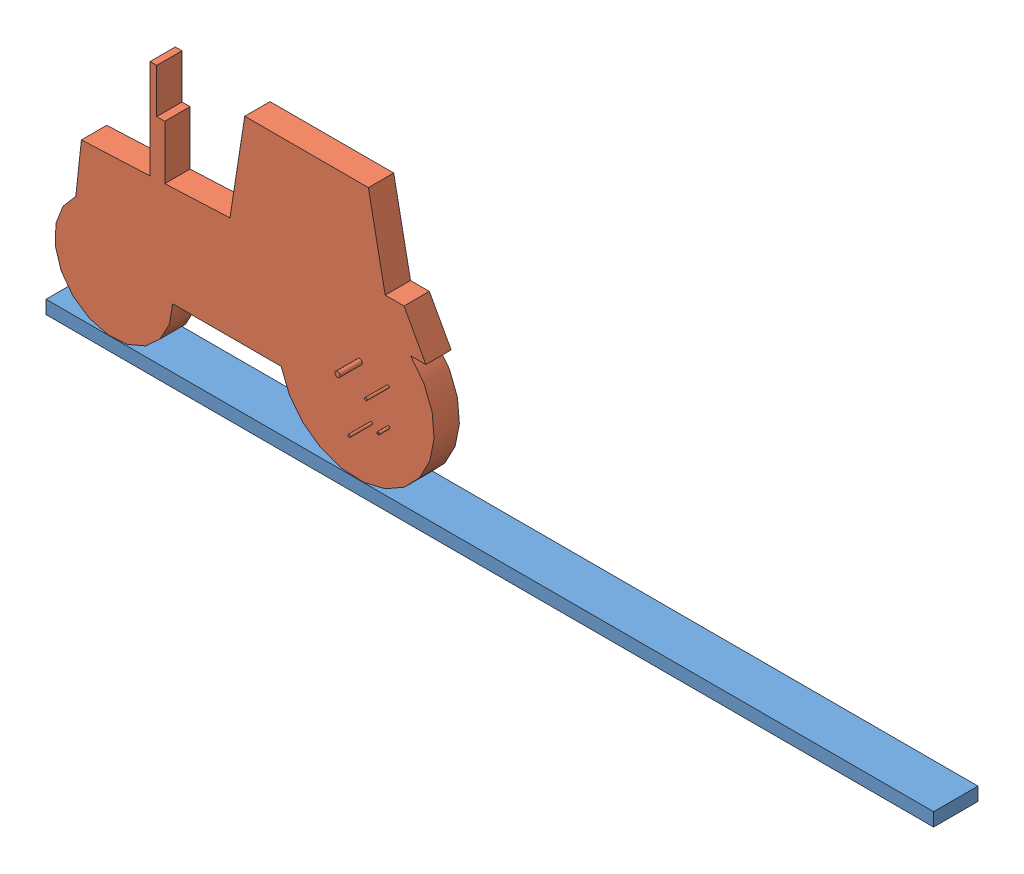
SolidWorks assembly tracteur sol.SLDASM, configuration Défaut (file format 3100). Lengths in mm.
Overall size (10000 3055.23 750).
2 component instances, 2 part files, 3 mates.
Components (placement in the parent):
- sol-2: sol.SLDPRT [Défaut] at origin size (10000 150 500)
- silhouette tracteur-1: silhouette tracteur.SLDPRT [Défaut] at (2400.1673 1349.0358 352.5) size (4275.04 2905.23 535)
Mates (geometry in assembly coordinates):
- Coïncidente3: coincident aligned: plane of sol-2 through (0 -150 500) normal (0 0 1); plane of silhouette tracteur-1 through (-1788.3233 1452.6166 500) normal (0 0 1)
- Tangent1: tangent anti-aligned: plane of sol-2 through (0 0 500) normal (0 1 0); cylinder of silhouette tracteur-1
- Tangent2: tangent anti-aligned: plane of sol-2 through (0 0 500) normal (0 1 0); cylinder of silhouette tracteur-1
